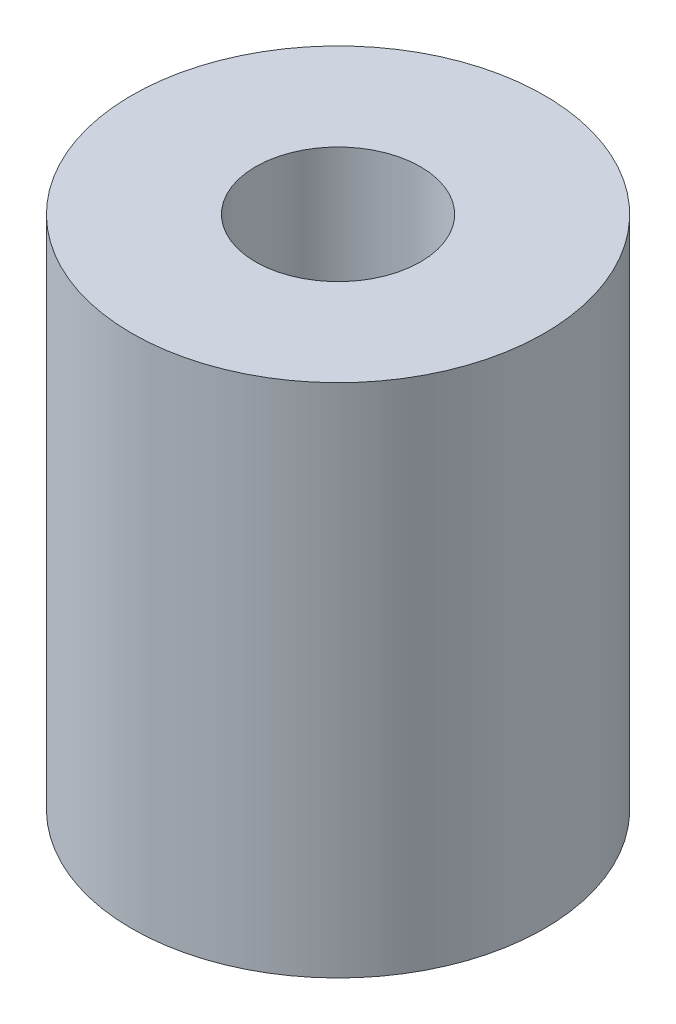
ISO-10303-21;
HEADER;
FILE_DESCRIPTION(('STEP AP214'),'2;1');
FILE_NAME('part.step','',(''),(''),'','','');
FILE_SCHEMA(('AUTOMOTIVE_DESIGN { 1 0 10303 214 1 1 1 1 }'));
ENDSEC;
DATA;
#1=APPLICATION_CONTEXT('core data for automotive mechanical design processes');
#2=APPLICATION_PROTOCOL_DEFINITION('international standard','automotive_design',2000,#1);
#3=PRODUCT_CONTEXT('',#1,'mechanical');
#4=PRODUCT('Part','Part','',(#3));
#5=PRODUCT_RELATED_PRODUCT_CATEGORY('part','',(#4));
#6=PRODUCT_DEFINITION_FORMATION('','',#4);
#7=PRODUCT_DEFINITION_CONTEXT('part definition',#1,'design');
#8=PRODUCT_DEFINITION('design','',#6,#7);
#9=PRODUCT_DEFINITION_SHAPE('','',#8);
#10=(LENGTH_UNIT() NAMED_UNIT(*) SI_UNIT(.MILLI.,.METRE.));
#11=(NAMED_UNIT(*) PLANE_ANGLE_UNIT() SI_UNIT($,.RADIAN.));
#12=(NAMED_UNIT(*) SI_UNIT($,.STERADIAN.) SOLID_ANGLE_UNIT());
#13=UNCERTAINTY_MEASURE_WITH_UNIT(LENGTH_MEASURE(1.E-05),#10,'distance_accuracy_value','');
#14=(GEOMETRIC_REPRESENTATION_CONTEXT(3) GLOBAL_UNCERTAINTY_ASSIGNED_CONTEXT((#13)) GLOBAL_UNIT_ASSIGNED_CONTEXT((#10,
#11,#12)) REPRESENTATION_CONTEXT('',''));
#15=CARTESIAN_POINT('',(0.,0.,0.));
#16=DIRECTION('',(0.,0.,1.));
#17=DIRECTION('',(1.,0.,0.));
#18=AXIS2_PLACEMENT_3D('',#15,#16,#17);
#19=CARTESIAN_POINT('',(-3.00073253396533,183.579999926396,26.9999931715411));
#20=DIRECTION('',(0.,-1.,0.));
#21=DIRECTION('',(0.,0.,-1.));
#22=AXIS2_PLACEMENT_3D('',#19,#20,#21);
#23=PLANE('',#22);
#24=CARTESIAN_POINT('',(-0.000732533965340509,183.579999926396,26.999993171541));
#25=DIRECTION('',(0.,1.,0.));
#26=DIRECTION('',(0.,0.,1.));
#27=AXIS2_PLACEMENT_3D('',#24,#25,#26);
#28=CIRCLE('',#27,6.);
#29=CARTESIAN_POINT('',(-0.000732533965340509,183.579999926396,32.999993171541));
#30=VERTEX_POINT('',#29);
#31=EDGE_CURVE('E17',#30,#30,#28,.T.);
#32=ORIENTED_EDGE('',*,*,#31,.F.);
#33=EDGE_LOOP('',(#32));
#34=FACE_BOUND('',#33,.T.);
#35=CARTESIAN_POINT('',(-0.000732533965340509,183.579999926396,26.999993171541));
#36=DIRECTION('',(0.,-1.,0.));
#37=DIRECTION('',(0.,0.,-1.));
#38=AXIS2_PLACEMENT_3D('',#35,#36,#37);
#39=CIRCLE('',#38,4.);
#40=CARTESIAN_POINT('',(-0.000732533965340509,183.579999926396,22.999993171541));
#41=VERTEX_POINT('',#40);
#42=EDGE_CURVE('E33',#41,#41,#39,.F.);
#43=ORIENTED_EDGE('',*,*,#42,.T.);
#44=EDGE_LOOP('',(#43));
#45=FACE_BOUND('',#44,.T.);
#46=ADVANCED_FACE('F13',(#34,#45),#23,.T.);
#47=CARTESIAN_POINT('',(-0.000732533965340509,171.579999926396,26.999993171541));
#48=DIRECTION('',(0.,1.,0.));
#49=DIRECTION('',(0.,0.,1.));
#50=AXIS2_PLACEMENT_3D('',#47,#48,#49);
#51=CYLINDRICAL_SURFACE('',#50,6.);
#52=CARTESIAN_POINT('',(-0.000732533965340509,171.579999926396,26.999993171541));
#53=DIRECTION('',(0.,1.,0.));
#54=DIRECTION('',(0.,0.,1.));
#55=AXIS2_PLACEMENT_3D('',#52,#53,#54);
#56=CIRCLE('',#55,6.);
#57=CARTESIAN_POINT('',(-0.000732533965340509,171.579999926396,32.999993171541));
#58=VERTEX_POINT('',#57);
#59=EDGE_CURVE('E31',#58,#58,#56,.T.);
#60=ORIENTED_EDGE('',*,*,#59,.F.);
#61=EDGE_LOOP('',(#60));
#62=FACE_BOUND('',#61,.T.);
#63=ORIENTED_EDGE('',*,*,#31,.T.);
#64=EDGE_LOOP('',(#63));
#65=FACE_BOUND('',#64,.T.);
#66=ADVANCED_FACE('F40',(#62,#65),#51,.F.);
#67=CARTESIAN_POINT('',(-0.000732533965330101,196.579999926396,26.999993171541));
#68=DIRECTION('',(0.,-1.,0.));
#69=DIRECTION('',(0.,0.,-1.));
#70=AXIS2_PLACEMENT_3D('',#67,#68,#69);
#71=CYLINDRICAL_SURFACE('',#70,4.);
#72=CARTESIAN_POINT('',(-0.000732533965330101,196.579999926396,26.999993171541));
#73=DIRECTION('',(0.,-1.,0.));
#74=DIRECTION('',(0.,0.,-1.));
#75=AXIS2_PLACEMENT_3D('',#72,#73,#74);
#76=CIRCLE('',#75,4.);
#77=CARTESIAN_POINT('',(-0.000732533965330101,196.579999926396,22.999993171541));
#78=VERTEX_POINT('',#77);
#79=EDGE_CURVE('E26',#78,#78,#76,.T.);
#80=ORIENTED_EDGE('',*,*,#79,.F.);
#81=EDGE_LOOP('',(#80));
#82=FACE_BOUND('',#81,.T.);
#83=ORIENTED_EDGE('',*,*,#42,.F.);
#84=EDGE_LOOP('',(#83));
#85=FACE_BOUND('',#84,.T.);
#86=ADVANCED_FACE('F43',(#82,#85),#71,.F.);
#87=CARTESIAN_POINT('',(-8.00073253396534,171.579999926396,26.999993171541));
#88=DIRECTION('',(0.,-1.,0.));
#89=DIRECTION('',(0.,0.,-1.));
#90=AXIS2_PLACEMENT_3D('',#87,#88,#89);
#91=PLANE('',#90);
#92=ORIENTED_EDGE('',*,*,#59,.T.);
#93=EDGE_LOOP('',(#92));
#94=FACE_BOUND('',#93,.T.);
#95=CARTESIAN_POINT('',(-0.000732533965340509,171.579999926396,26.999993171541));
#96=DIRECTION('',(0.,1.,0.));
#97=DIRECTION('',(0.,0.,1.));
#98=AXIS2_PLACEMENT_3D('',#95,#96,#97);
#99=CIRCLE('',#98,10.);
#100=CARTESIAN_POINT('',(-0.000732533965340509,171.579999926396,36.999993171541));
#101=VERTEX_POINT('',#100);
#102=EDGE_CURVE('E21',#101,#101,#99,.T.);
#103=ORIENTED_EDGE('',*,*,#102,.F.);
#104=EDGE_LOOP('',(#103));
#105=FACE_BOUND('',#104,.T.);
#106=ADVANCED_FACE('F48',(#94,#105),#91,.T.);
#107=CARTESIAN_POINT('',(-5.00073253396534,196.579999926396,26.9999931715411));
#108=DIRECTION('',(0.,1.,0.));
#109=DIRECTION('',(0.,0.,1.));
#110=AXIS2_PLACEMENT_3D('',#107,#108,#109);
#111=PLANE('',#110);
#112=CARTESIAN_POINT('',(-0.000732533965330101,196.579999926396,26.999993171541));
#113=DIRECTION('',(0.,1.,0.));
#114=DIRECTION('',(0.,0.,1.));
#115=AXIS2_PLACEMENT_3D('',#112,#113,#114);
#116=CIRCLE('',#115,10.);
#117=CARTESIAN_POINT('',(-0.000732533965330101,196.579999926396,36.999993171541));
#118=VERTEX_POINT('',#117);
#119=EDGE_CURVE('E9',#118,#118,#116,.F.);
#120=ORIENTED_EDGE('',*,*,#119,.F.);
#121=EDGE_LOOP('',(#120));
#122=FACE_BOUND('',#121,.T.);
#123=ORIENTED_EDGE('',*,*,#79,.T.);
#124=EDGE_LOOP('',(#123));
#125=FACE_BOUND('',#124,.T.);
#126=ADVANCED_FACE('F46',(#122,#125),#111,.T.);
#127=CARTESIAN_POINT('',(-0.000732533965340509,171.579999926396,26.999993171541));
#128=DIRECTION('',(0.,1.,0.));
#129=DIRECTION('',(0.,0.,1.));
#130=AXIS2_PLACEMENT_3D('',#127,#128,#129);
#131=CYLINDRICAL_SURFACE('',#130,10.);
#132=ORIENTED_EDGE('',*,*,#102,.T.);
#133=EDGE_LOOP('',(#132));
#134=FACE_BOUND('',#133,.T.);
#135=ORIENTED_EDGE('',*,*,#119,.T.);
#136=EDGE_LOOP('',(#135));
#137=FACE_BOUND('',#136,.T.);
#138=ADVANCED_FACE('F15',(#134,#137),#131,.T.);
#139=CLOSED_SHELL('',(#46,#66,#86,#106,#126,#138));
#140=MANIFOLD_SOLID_BREP('B1',#139);
#141=ADVANCED_BREP_SHAPE_REPRESENTATION('',(#18,#140),#14);
#142=SHAPE_DEFINITION_REPRESENTATION(#9,#141);
ENDSEC;
END-ISO-10303-21;
